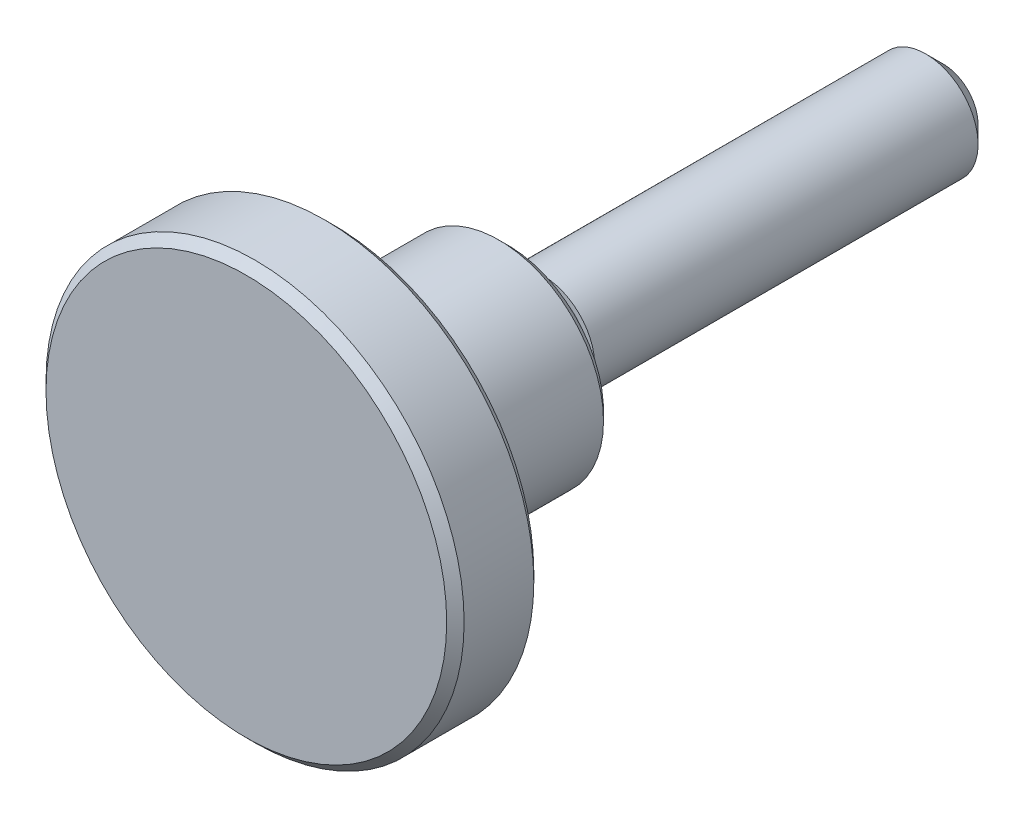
ISO-10303-21;
HEADER;
FILE_DESCRIPTION(('STEP AP214'),'2;1');
FILE_NAME('part.step','',(''),(''),'','','');
FILE_SCHEMA(('AUTOMOTIVE_DESIGN { 1 0 10303 214 1 1 1 1 }'));
ENDSEC;
DATA;
#1=APPLICATION_CONTEXT('core data for automotive mechanical design processes');
#2=APPLICATION_PROTOCOL_DEFINITION('international standard','automotive_design',2000,#1);
#3=PRODUCT_CONTEXT('',#1,'mechanical');
#4=PRODUCT('Part','Part','',(#3));
#5=PRODUCT_RELATED_PRODUCT_CATEGORY('part','',(#4));
#6=PRODUCT_DEFINITION_FORMATION('','',#4);
#7=PRODUCT_DEFINITION_CONTEXT('part definition',#1,'design');
#8=PRODUCT_DEFINITION('design','',#6,#7);
#9=PRODUCT_DEFINITION_SHAPE('','',#8);
#10=(LENGTH_UNIT() NAMED_UNIT(*) SI_UNIT(.MILLI.,.METRE.));
#11=(NAMED_UNIT(*) PLANE_ANGLE_UNIT() SI_UNIT($,.RADIAN.));
#12=(NAMED_UNIT(*) SI_UNIT($,.STERADIAN.) SOLID_ANGLE_UNIT());
#13=UNCERTAINTY_MEASURE_WITH_UNIT(LENGTH_MEASURE(1.E-05),#10,'distance_accuracy_value','');
#14=(GEOMETRIC_REPRESENTATION_CONTEXT(3) GLOBAL_UNCERTAINTY_ASSIGNED_CONTEXT((#13)) GLOBAL_UNIT_ASSIGNED_CONTEXT((#10,
#11,#12)) REPRESENTATION_CONTEXT('',''));
#15=CARTESIAN_POINT('',(0.,0.,0.));
#16=DIRECTION('',(0.,0.,1.));
#17=DIRECTION('',(1.,0.,0.));
#18=AXIS2_PLACEMENT_3D('',#15,#16,#17);
#19=CARTESIAN_POINT('',(0.,2.,-25.));
#20=DIRECTION('',(0.,0.,-1.));
#21=DIRECTION('',(-1.,0.,0.));
#22=AXIS2_PLACEMENT_3D('',#19,#20,#21);
#23=PLANE('',#22);
#24=CARTESIAN_POINT('',(0.,0.,-25.));
#25=DIRECTION('',(0.,0.,-1.));
#26=DIRECTION('',(-1.,0.,0.));
#27=AXIS2_PLACEMENT_3D('',#24,#25,#26);
#28=CIRCLE('',#27,2.);
#29=CARTESIAN_POINT('',(-2.,0.,-25.));
#30=VERTEX_POINT('',#29);
#31=EDGE_CURVE('E8',#30,#30,#28,.T.);
#32=ORIENTED_EDGE('',*,*,#31,.T.);
#33=EDGE_LOOP('',(#32));
#34=FACE_BOUND('',#33,.T.);
#35=ADVANCED_FACE('F12',(#34),#23,.T.);
#36=CARTESIAN_POINT('',(0.,0.,-25.));
#37=DIRECTION('',(0.,0.,1.));
#38=DIRECTION('',(1.,0.,0.));
#39=AXIS2_PLACEMENT_3D('',#36,#37,#38);
#40=CONICAL_SURFACE('',#39,2.,0.785398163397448);
#41=CARTESIAN_POINT('',(0.,0.,-24.));
#42=DIRECTION('',(0.,0.,-1.));
#43=DIRECTION('',(-1.,0.,0.));
#44=AXIS2_PLACEMENT_3D('',#41,#42,#43);
#45=CIRCLE('',#44,3.);
#46=CARTESIAN_POINT('',(-3.,0.,-24.));
#47=VERTEX_POINT('',#46);
#48=EDGE_CURVE('E18',#47,#47,#45,.T.);
#49=ORIENTED_EDGE('',*,*,#48,.T.);
#50=EDGE_LOOP('',(#49));
#51=FACE_BOUND('',#50,.T.);
#52=ORIENTED_EDGE('',*,*,#31,.F.);
#53=EDGE_LOOP('',(#52));
#54=FACE_BOUND('',#53,.T.);
#55=ADVANCED_FACE('F79',(#51,#54),#40,.T.);
#56=CARTESIAN_POINT('',(0.,0.,-27.5));
#57=DIRECTION('',(0.,0.,-1.));
#58=DIRECTION('',(-1.,0.,0.));
#59=AXIS2_PLACEMENT_3D('',#56,#57,#58);
#60=CYLINDRICAL_SURFACE('',#59,3.);
#61=CARTESIAN_POINT('',(0.,0.,-2.));
#62=DIRECTION('',(0.,0.,-1.));
#63=DIRECTION('',(-1.,0.,0.));
#64=AXIS2_PLACEMENT_3D('',#61,#62,#63);
#65=CIRCLE('',#64,3.);
#66=CARTESIAN_POINT('',(-3.,0.,-2.));
#67=VERTEX_POINT('',#66);
#68=EDGE_CURVE('E22',#67,#67,#65,.T.);
#69=ORIENTED_EDGE('',*,*,#68,.T.);
#70=EDGE_LOOP('',(#69));
#71=FACE_BOUND('',#70,.T.);
#72=ORIENTED_EDGE('',*,*,#48,.F.);
#73=EDGE_LOOP('',(#72));
#74=FACE_BOUND('',#73,.T.);
#75=ADVANCED_FACE('F84',(#71,#74),#60,.T.);
#76=CARTESIAN_POINT('',(0.,3.,-2.));
#77=DIRECTION('',(0.,0.,1.));
#78=DIRECTION('',(1.,0.,0.));
#79=AXIS2_PLACEMENT_3D('',#76,#77,#78);
#80=PLANE('',#79);
#81=CARTESIAN_POINT('',(0.,0.,-2.));
#82=DIRECTION('',(0.,0.,-1.));
#83=DIRECTION('',(-1.,0.,0.));
#84=AXIS2_PLACEMENT_3D('',#81,#82,#83);
#85=CIRCLE('',#84,2.7);
#86=CARTESIAN_POINT('',(-2.7,0.,-2.));
#87=VERTEX_POINT('',#86);
#88=EDGE_CURVE('E26',#87,#87,#85,.T.);
#89=ORIENTED_EDGE('',*,*,#88,.T.);
#90=EDGE_LOOP('',(#89));
#91=FACE_BOUND('',#90,.T.);
#92=ORIENTED_EDGE('',*,*,#68,.F.);
#93=EDGE_LOOP('',(#92));
#94=FACE_BOUND('',#93,.T.);
#95=ADVANCED_FACE('F89',(#91,#94),#80,.T.);
#96=CARTESIAN_POINT('',(0.,0.,-1.5));
#97=DIRECTION('',(0.,0.,-1.));
#98=DIRECTION('',(-1.,0.,0.));
#99=AXIS2_PLACEMENT_3D('',#96,#97,#98);
#100=TOROIDAL_SURFACE('',#99,2.7,0.5);
#101=CARTESIAN_POINT('',(0.,0.,-1.5));
#102=DIRECTION('',(0.,0.,-1.));
#103=DIRECTION('',(-1.,0.,0.));
#104=AXIS2_PLACEMENT_3D('',#101,#102,#103);
#105=CIRCLE('',#104,2.2);
#106=CARTESIAN_POINT('',(-2.2,0.,-1.5));
#107=VERTEX_POINT('',#106);
#108=EDGE_CURVE('E31',#107,#107,#105,.T.);
#109=ORIENTED_EDGE('',*,*,#108,.T.);
#110=EDGE_LOOP('',(#109));
#111=FACE_BOUND('',#110,.T.);
#112=ORIENTED_EDGE('',*,*,#88,.F.);
#113=EDGE_LOOP('',(#112));
#114=FACE_BOUND('',#113,.T.);
#115=ADVANCED_FACE('F96',(#111,#114),#100,.F.);
#116=CARTESIAN_POINT('',(0.,0.,-27.5));
#117=DIRECTION('',(0.,0.,-1.));
#118=DIRECTION('',(-1.,0.,0.));
#119=AXIS2_PLACEMENT_3D('',#116,#117,#118);
#120=CYLINDRICAL_SURFACE('',#119,2.2);
#121=CARTESIAN_POINT('',(0.,0.,-0.5));
#122=DIRECTION('',(0.,0.,-1.));
#123=DIRECTION('',(-1.,0.,0.));
#124=AXIS2_PLACEMENT_3D('',#121,#122,#123);
#125=CIRCLE('',#124,2.2);
#126=CARTESIAN_POINT('',(-2.2,0.,-0.5));
#127=VERTEX_POINT('',#126);
#128=EDGE_CURVE('E34',#127,#127,#125,.T.);
#129=ORIENTED_EDGE('',*,*,#128,.T.);
#130=EDGE_LOOP('',(#129));
#131=FACE_BOUND('',#130,.T.);
#132=ORIENTED_EDGE('',*,*,#108,.F.);
#133=EDGE_LOOP('',(#132));
#134=FACE_BOUND('',#133,.T.);
#135=ADVANCED_FACE('F100',(#131,#134),#120,.T.);
#136=CARTESIAN_POINT('',(0.,0.,-0.5));
#137=DIRECTION('',(0.,0.,-1.));
#138=DIRECTION('',(-1.,0.,0.));
#139=AXIS2_PLACEMENT_3D('',#136,#137,#138);
#140=TOROIDAL_SURFACE('',#139,2.7,0.5);
#141=CARTESIAN_POINT('',(0.,0.,0.));
#142=DIRECTION('',(0.,0.,-1.));
#143=DIRECTION('',(-1.,0.,0.));
#144=AXIS2_PLACEMENT_3D('',#141,#142,#143);
#145=CIRCLE('',#144,2.7);
#146=CARTESIAN_POINT('',(-2.7,0.,0.));
#147=VERTEX_POINT('',#146);
#148=EDGE_CURVE('E37',#147,#147,#145,.T.);
#149=ORIENTED_EDGE('',*,*,#148,.T.);
#150=EDGE_LOOP('',(#149));
#151=FACE_BOUND('',#150,.T.);
#152=ORIENTED_EDGE('',*,*,#128,.F.);
#153=EDGE_LOOP('',(#152));
#154=FACE_BOUND('',#153,.T.);
#155=ADVANCED_FACE('F104',(#151,#154),#140,.F.);
#156=CARTESIAN_POINT('',(0.,5.5,0.));
#157=DIRECTION('',(0.,0.,-1.));
#158=DIRECTION('',(-1.,0.,0.));
#159=AXIS2_PLACEMENT_3D('',#156,#157,#158);
#160=PLANE('',#159);
#161=CARTESIAN_POINT('',(0.,0.,0.));
#162=DIRECTION('',(0.,0.,-1.));
#163=DIRECTION('',(-1.,0.,0.));
#164=AXIS2_PLACEMENT_3D('',#161,#162,#163);
#165=CIRCLE('',#164,5.5);
#166=CARTESIAN_POINT('',(-5.5,0.,0.));
#167=VERTEX_POINT('',#166);
#168=EDGE_CURVE('E40',#167,#167,#165,.T.);
#169=ORIENTED_EDGE('',*,*,#168,.T.);
#170=EDGE_LOOP('',(#169));
#171=FACE_BOUND('',#170,.T.);
#172=ORIENTED_EDGE('',*,*,#148,.F.);
#173=EDGE_LOOP('',(#172));
#174=FACE_BOUND('',#173,.T.);
#175=ADVANCED_FACE('F108',(#171,#174),#160,.T.);
#176=CARTESIAN_POINT('',(0.,0.,0.));
#177=DIRECTION('',(0.,0.,1.));
#178=DIRECTION('',(1.,0.,0.));
#179=AXIS2_PLACEMENT_3D('',#176,#177,#178);
#180=CONICAL_SURFACE('',#179,5.5,0.785398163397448);
#181=CARTESIAN_POINT('',(0.,0.,0.5));
#182=DIRECTION('',(0.,0.,-1.));
#183=DIRECTION('',(-1.,0.,0.));
#184=AXIS2_PLACEMENT_3D('',#181,#182,#183);
#185=CIRCLE('',#184,6.);
#186=CARTESIAN_POINT('',(-6.,0.,0.5));
#187=VERTEX_POINT('',#186);
#188=EDGE_CURVE('E43',#187,#187,#185,.T.);
#189=ORIENTED_EDGE('',*,*,#188,.T.);
#190=EDGE_LOOP('',(#189));
#191=FACE_BOUND('',#190,.T.);
#192=ORIENTED_EDGE('',*,*,#168,.F.);
#193=EDGE_LOOP('',(#192));
#194=FACE_BOUND('',#193,.T.);
#195=ADVANCED_FACE('F112',(#191,#194),#180,.T.);
#196=CARTESIAN_POINT('',(0.,0.,-27.5));
#197=DIRECTION('',(0.,0.,-1.));
#198=DIRECTION('',(-1.,0.,0.));
#199=AXIS2_PLACEMENT_3D('',#196,#197,#198);
#200=CYLINDRICAL_SURFACE('',#199,6.);
#201=CARTESIAN_POINT('',(0.,0.,9.));
#202=DIRECTION('',(0.,0.,-1.));
#203=DIRECTION('',(-1.,0.,0.));
#204=AXIS2_PLACEMENT_3D('',#201,#202,#203);
#205=CIRCLE('',#204,6.);
#206=CARTESIAN_POINT('',(-6.,0.,9.));
#207=VERTEX_POINT('',#206);
#208=EDGE_CURVE('E46',#207,#207,#205,.T.);
#209=ORIENTED_EDGE('',*,*,#208,.T.);
#210=EDGE_LOOP('',(#209));
#211=FACE_BOUND('',#210,.T.);
#212=ORIENTED_EDGE('',*,*,#188,.F.);
#213=EDGE_LOOP('',(#212));
#214=FACE_BOUND('',#213,.T.);
#215=ADVANCED_FACE('F116',(#211,#214),#200,.T.);
#216=CARTESIAN_POINT('',(0.,0.,9.));
#217=DIRECTION('',(0.,0.,-1.));
#218=DIRECTION('',(-1.,0.,0.));
#219=AXIS2_PLACEMENT_3D('',#216,#217,#218);
#220=TOROIDAL_SURFACE('',#219,7.,1.);
#221=CARTESIAN_POINT('',(0.,0.,10.));
#222=DIRECTION('',(0.,0.,-1.));
#223=DIRECTION('',(-1.,0.,0.));
#224=AXIS2_PLACEMENT_3D('',#221,#222,#223);
#225=CIRCLE('',#224,7.);
#226=CARTESIAN_POINT('',(-7.,0.,10.));
#227=VERTEX_POINT('',#226);
#228=EDGE_CURVE('E49',#227,#227,#225,.T.);
#229=ORIENTED_EDGE('',*,*,#228,.T.);
#230=EDGE_LOOP('',(#229));
#231=FACE_BOUND('',#230,.T.);
#232=ORIENTED_EDGE('',*,*,#208,.F.);
#233=EDGE_LOOP('',(#232));
#234=FACE_BOUND('',#233,.T.);
#235=ADVANCED_FACE('F120',(#231,#234),#220,.F.);
#236=CARTESIAN_POINT('',(0.,11.5,10.));
#237=DIRECTION('',(0.,0.,-1.));
#238=DIRECTION('',(-1.,0.,0.));
#239=AXIS2_PLACEMENT_3D('',#236,#237,#238);
#240=PLANE('',#239);
#241=CARTESIAN_POINT('',(0.,0.,10.));
#242=DIRECTION('',(0.,0.,-1.));
#243=DIRECTION('',(-1.,0.,0.));
#244=AXIS2_PLACEMENT_3D('',#241,#242,#243);
#245=CIRCLE('',#244,11.5);
#246=CARTESIAN_POINT('',(-11.5,0.,10.));
#247=VERTEX_POINT('',#246);
#248=EDGE_CURVE('E52',#247,#247,#245,.T.);
#249=ORIENTED_EDGE('',*,*,#248,.T.);
#250=EDGE_LOOP('',(#249));
#251=FACE_BOUND('',#250,.T.);
#252=ORIENTED_EDGE('',*,*,#228,.F.);
#253=EDGE_LOOP('',(#252));
#254=FACE_BOUND('',#253,.T.);
#255=ADVANCED_FACE('F124',(#251,#254),#240,.T.);
#256=CARTESIAN_POINT('',(0.,0.,10.));
#257=DIRECTION('',(0.,0.,1.));
#258=DIRECTION('',(1.,0.,0.));
#259=AXIS2_PLACEMENT_3D('',#256,#257,#258);
#260=CONICAL_SURFACE('',#259,11.5,0.785398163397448);
#261=CARTESIAN_POINT('',(0.,0.,10.5));
#262=DIRECTION('',(0.,0.,-1.));
#263=DIRECTION('',(-1.,0.,0.));
#264=AXIS2_PLACEMENT_3D('',#261,#262,#263);
#265=CIRCLE('',#264,12.);
#266=CARTESIAN_POINT('',(-12.,0.,10.5));
#267=VERTEX_POINT('',#266);
#268=EDGE_CURVE('E55',#267,#267,#265,.T.);
#269=ORIENTED_EDGE('',*,*,#268,.T.);
#270=EDGE_LOOP('',(#269));
#271=FACE_BOUND('',#270,.T.);
#272=ORIENTED_EDGE('',*,*,#248,.F.);
#273=EDGE_LOOP('',(#272));
#274=FACE_BOUND('',#273,.T.);
#275=ADVANCED_FACE('F128',(#271,#274),#260,.T.);
#276=CARTESIAN_POINT('',(0.,0.,-27.5));
#277=DIRECTION('',(0.,0.,-1.));
#278=DIRECTION('',(-1.,0.,0.));
#279=AXIS2_PLACEMENT_3D('',#276,#277,#278);
#280=CYLINDRICAL_SURFACE('',#279,12.);
#281=CARTESIAN_POINT('',(0.,0.,14.5));
#282=DIRECTION('',(0.,0.,-1.));
#283=DIRECTION('',(-1.,0.,0.));
#284=AXIS2_PLACEMENT_3D('',#281,#282,#283);
#285=CIRCLE('',#284,12.);
#286=CARTESIAN_POINT('',(-12.,0.,14.5));
#287=VERTEX_POINT('',#286);
#288=EDGE_CURVE('E58',#287,#287,#285,.T.);
#289=ORIENTED_EDGE('',*,*,#288,.T.);
#290=EDGE_LOOP('',(#289));
#291=FACE_BOUND('',#290,.T.);
#292=ORIENTED_EDGE('',*,*,#268,.F.);
#293=EDGE_LOOP('',(#292));
#294=FACE_BOUND('',#293,.T.);
#295=ADVANCED_FACE('F76',(#291,#294),#280,.T.);
#296=CARTESIAN_POINT('',(0.,0.,14.5));
#297=DIRECTION('',(0.,0.,-1.));
#298=DIRECTION('',(-1.,0.,0.));
#299=AXIS2_PLACEMENT_3D('',#296,#297,#298);
#300=CONICAL_SURFACE('',#299,12.,0.785398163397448);
#301=CARTESIAN_POINT('',(0.,0.,15.));
#302=DIRECTION('',(0.,0.,-1.));
#303=DIRECTION('',(-1.,0.,0.));
#304=AXIS2_PLACEMENT_3D('',#301,#302,#303);
#305=CIRCLE('',#304,11.5);
#306=CARTESIAN_POINT('',(-11.5,0.,15.));
#307=VERTEX_POINT('',#306);
#308=EDGE_CURVE('E61',#307,#307,#305,.T.);
#309=ORIENTED_EDGE('',*,*,#308,.T.);
#310=EDGE_LOOP('',(#309));
#311=FACE_BOUND('',#310,.T.);
#312=ORIENTED_EDGE('',*,*,#288,.F.);
#313=EDGE_LOOP('',(#312));
#314=FACE_BOUND('',#313,.T.);
#315=ADVANCED_FACE('F65',(#311,#314),#300,.T.);
#316=CARTESIAN_POINT('',(0.,11.5,15.));
#317=DIRECTION('',(0.,0.,1.));
#318=DIRECTION('',(1.,0.,0.));
#319=AXIS2_PLACEMENT_3D('',#316,#317,#318);
#320=PLANE('',#319);
#321=ORIENTED_EDGE('',*,*,#308,.F.);
#322=EDGE_LOOP('',(#321));
#323=FACE_BOUND('',#322,.T.);
#324=ADVANCED_FACE('F68',(#323),#320,.T.);
#325=CLOSED_SHELL('',(#35,#55,#75,#95,#115,#135,#155,#175,#195,#215,#235,#255,#275,#295,#315,#324));
#326=MANIFOLD_SOLID_BREP('B1',#325);
#327=ADVANCED_BREP_SHAPE_REPRESENTATION('',(#18,#326),#14);
#328=SHAPE_DEFINITION_REPRESENTATION(#9,#327);
ENDSEC;
END-ISO-10303-21;
